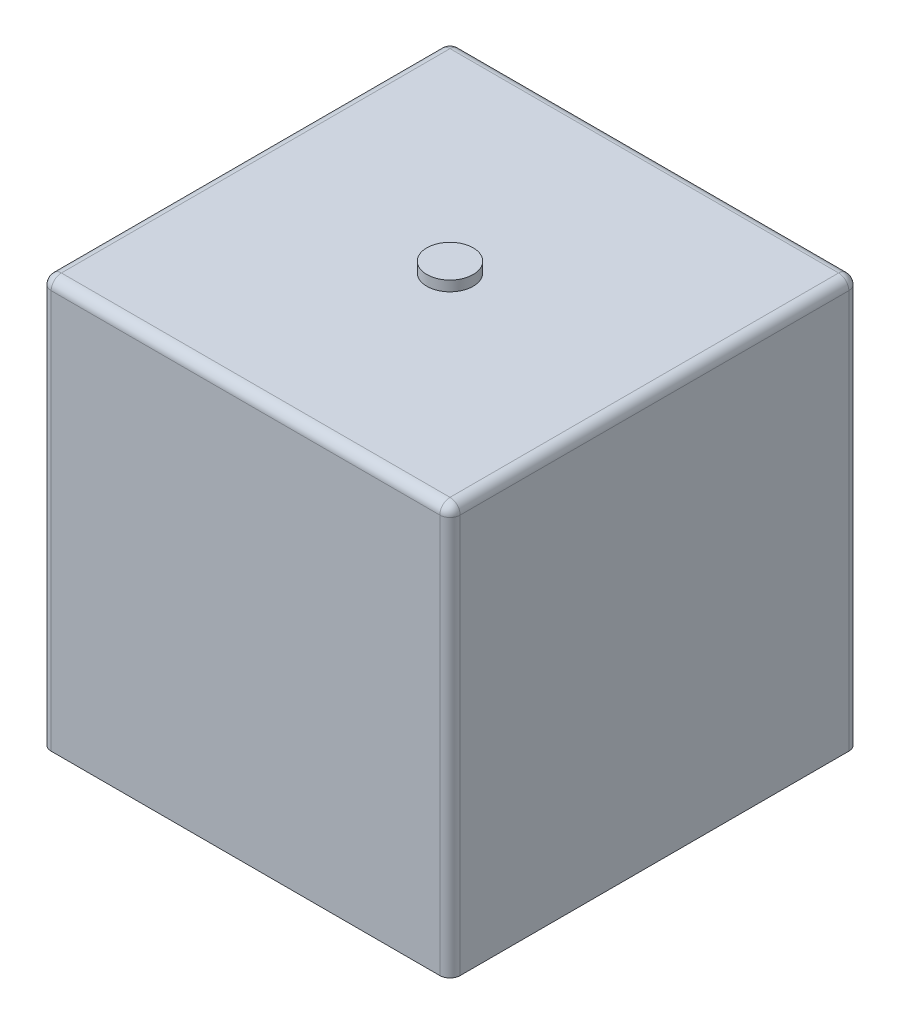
ISO-10303-21;
HEADER;
FILE_DESCRIPTION(('STEP AP214'),'2;1');
FILE_NAME('part.step','',(''),(''),'','','');
FILE_SCHEMA(('AUTOMOTIVE_DESIGN { 1 0 10303 214 1 1 1 1 }'));
ENDSEC;
DATA;
#1=APPLICATION_CONTEXT('core data for automotive mechanical design processes');
#2=APPLICATION_PROTOCOL_DEFINITION('international standard','automotive_design',2000,#1);
#3=PRODUCT_CONTEXT('',#1,'mechanical');
#4=PRODUCT('Part','Part','',(#3));
#5=PRODUCT_RELATED_PRODUCT_CATEGORY('part','',(#4));
#6=PRODUCT_DEFINITION_FORMATION('','',#4);
#7=PRODUCT_DEFINITION_CONTEXT('part definition',#1,'design');
#8=PRODUCT_DEFINITION('design','',#6,#7);
#9=PRODUCT_DEFINITION_SHAPE('','',#8);
#10=(LENGTH_UNIT() NAMED_UNIT(*) SI_UNIT(.MILLI.,.METRE.));
#11=(NAMED_UNIT(*) PLANE_ANGLE_UNIT() SI_UNIT($,.RADIAN.));
#12=(NAMED_UNIT(*) SI_UNIT($,.STERADIAN.) SOLID_ANGLE_UNIT());
#13=UNCERTAINTY_MEASURE_WITH_UNIT(LENGTH_MEASURE(1.E-05),#10,'distance_accuracy_value','');
#14=(GEOMETRIC_REPRESENTATION_CONTEXT(3) GLOBAL_UNCERTAINTY_ASSIGNED_CONTEXT((#13)) GLOBAL_UNIT_ASSIGNED_CONTEXT((#10,
#11,#12)) REPRESENTATION_CONTEXT('',''));
#15=CARTESIAN_POINT('',(0.,0.,0.));
#16=DIRECTION('',(0.,0.,1.));
#17=DIRECTION('',(1.,0.,0.));
#18=AXIS2_PLACEMENT_3D('',#15,#16,#17);
#19=CARTESIAN_POINT('',(0.,0.,20.));
#20=DIRECTION('',(1.,0.,0.));
#21=DIRECTION('',(0.,0.,-1.));
#22=AXIS2_PLACEMENT_3D('',#19,#20,#21);
#23=PLANE('',#22);
#24=DIRECTION('',(0.,0.,-1.));
#25=VECTOR('',#24,1.);
#26=CARTESIAN_POINT('',(0.,19.5,20.));
#27=LINE('',#26,#25);
#28=CARTESIAN_POINT('',(0.,19.5,19.5));
#29=VERTEX_POINT('',#28);
#30=CARTESIAN_POINT('',(0.,19.5,0.5));
#31=VERTEX_POINT('',#30);
#32=EDGE_CURVE('E145',#29,#31,#27,.T.);
#33=ORIENTED_EDGE('',*,*,#32,.T.);
#34=DIRECTION('',(0.,-1.,0.));
#35=VECTOR('',#34,1.);
#36=CARTESIAN_POINT('',(0.,0.,0.5));
#37=LINE('',#36,#35);
#38=CARTESIAN_POINT('',(0.,0.,0.5));
#39=VERTEX_POINT('',#38);
#40=EDGE_CURVE('E131',#31,#39,#37,.T.);
#41=ORIENTED_EDGE('',*,*,#40,.T.);
#42=DIRECTION('',(0.,0.,-1.));
#43=VECTOR('',#42,1.);
#44=CARTESIAN_POINT('',(0.,0.,20.));
#45=LINE('',#44,#43);
#46=CARTESIAN_POINT('',(0.,0.,19.5));
#47=VERTEX_POINT('',#46);
#48=EDGE_CURVE('E124',#47,#39,#45,.T.);
#49=ORIENTED_EDGE('',*,*,#48,.F.);
#50=DIRECTION('',(0.,-1.,0.));
#51=VECTOR('',#50,1.);
#52=CARTESIAN_POINT('',(0.,0.,19.5));
#53=LINE('',#52,#51);
#54=EDGE_CURVE('E135',#47,#29,#53,.F.);
#55=ORIENTED_EDGE('',*,*,#54,.T.);
#56=EDGE_LOOP('',(#33,#41,#49,#55));
#57=FACE_BOUND('',#56,.T.);
#58=ADVANCED_FACE('F41',(#57),#23,.F.);
#59=CARTESIAN_POINT('',(0.,0.,20.));
#60=DIRECTION('',(0.,1.,0.));
#61=DIRECTION('',(0.,0.,1.));
#62=AXIS2_PLACEMENT_3D('',#59,#60,#61);
#63=PLANE('',#62);
#64=ORIENTED_EDGE('',*,*,#48,.T.);
#65=CARTESIAN_POINT('',(0.5,0.,0.5));
#66=DIRECTION('',(0.,1.,0.));
#67=DIRECTION('',(0.,0.,1.));
#68=AXIS2_PLACEMENT_3D('',#65,#66,#67);
#69=CIRCLE('',#68,0.5);
#70=CARTESIAN_POINT('',(0.5,0.,0.));
#71=VERTEX_POINT('',#70);
#72=EDGE_CURVE('E155',#39,#71,#69,.F.);
#73=ORIENTED_EDGE('',*,*,#72,.T.);
#74=DIRECTION('',(1.,0.,0.));
#75=VECTOR('',#74,1.);
#76=CARTESIAN_POINT('',(0.,0.,0.));
#77=LINE('',#76,#75);
#78=CARTESIAN_POINT('',(19.5,0.,0.));
#79=VERTEX_POINT('',#78);
#80=EDGE_CURVE('E216',#71,#79,#77,.T.);
#81=ORIENTED_EDGE('',*,*,#80,.T.);
#82=CARTESIAN_POINT('',(19.5,0.,0.5));
#83=DIRECTION('',(0.,1.,0.));
#84=DIRECTION('',(0.,0.,1.));
#85=AXIS2_PLACEMENT_3D('',#82,#83,#84);
#86=CIRCLE('',#85,0.5);
#87=CARTESIAN_POINT('',(20.,0.,0.5));
#88=VERTEX_POINT('',#87);
#89=EDGE_CURVE('E153',#79,#88,#86,.F.);
#90=ORIENTED_EDGE('',*,*,#89,.T.);
#91=DIRECTION('',(0.,0.,-1.));
#92=VECTOR('',#91,1.);
#93=CARTESIAN_POINT('',(20.,0.,20.));
#94=LINE('',#93,#92);
#95=CARTESIAN_POINT('',(20.,0.,19.5));
#96=VERTEX_POINT('',#95);
#97=EDGE_CURVE('E139',#96,#88,#94,.T.);
#98=ORIENTED_EDGE('',*,*,#97,.F.);
#99=CARTESIAN_POINT('',(19.5,0.,19.5));
#100=DIRECTION('',(0.,1.,0.));
#101=DIRECTION('',(0.,0.,1.));
#102=AXIS2_PLACEMENT_3D('',#99,#100,#101);
#103=CIRCLE('',#102,0.5);
#104=CARTESIAN_POINT('',(19.5,0.,20.));
#105=VERTEX_POINT('',#104);
#106=EDGE_CURVE('E130',#96,#105,#103,.F.);
#107=ORIENTED_EDGE('',*,*,#106,.T.);
#108=DIRECTION('',(1.,0.,0.));
#109=VECTOR('',#108,1.);
#110=CARTESIAN_POINT('',(0.,0.,20.));
#111=LINE('',#110,#109);
#112=CARTESIAN_POINT('',(0.5,0.,20.));
#113=VERTEX_POINT('',#112);
#114=EDGE_CURVE('E126',#113,#105,#111,.T.);
#115=ORIENTED_EDGE('',*,*,#114,.F.);
#116=CARTESIAN_POINT('',(0.5,0.,19.5));
#117=DIRECTION('',(0.,1.,0.));
#118=DIRECTION('',(0.,0.,1.));
#119=AXIS2_PLACEMENT_3D('',#116,#117,#118);
#120=CIRCLE('',#119,0.5);
#121=EDGE_CURVE('E121',#113,#47,#120,.F.);
#122=ORIENTED_EDGE('',*,*,#121,.T.);
#123=EDGE_LOOP('',(#64,#73,#81,#90,#98,#107,#115,#122));
#124=FACE_BOUND('',#123,.T.);
#125=ADVANCED_FACE('F123',(#124),#63,.F.);
#126=CARTESIAN_POINT('',(20.,0.,20.));
#127=DIRECTION('',(-1.,0.,0.));
#128=DIRECTION('',(0.,0.,1.));
#129=AXIS2_PLACEMENT_3D('',#126,#127,#128);
#130=PLANE('',#129);
#131=ORIENTED_EDGE('',*,*,#97,.T.);
#132=DIRECTION('',(0.,1.,0.));
#133=VECTOR('',#132,1.);
#134=CARTESIAN_POINT('',(20.,20.,0.5));
#135=LINE('',#134,#133);
#136=CARTESIAN_POINT('',(20.,19.5,0.5));
#137=VERTEX_POINT('',#136);
#138=EDGE_CURVE('E167',#88,#137,#135,.T.);
#139=ORIENTED_EDGE('',*,*,#138,.T.);
#140=DIRECTION('',(0.,0.,-1.));
#141=VECTOR('',#140,1.);
#142=CARTESIAN_POINT('',(20.,19.5,20.));
#143=LINE('',#142,#141);
#144=CARTESIAN_POINT('',(20.,19.5,19.5));
#145=VERTEX_POINT('',#144);
#146=EDGE_CURVE('E163',#137,#145,#143,.F.);
#147=ORIENTED_EDGE('',*,*,#146,.T.);
#148=DIRECTION('',(0.,1.,0.));
#149=VECTOR('',#148,1.);
#150=CARTESIAN_POINT('',(20.,0.,19.5));
#151=LINE('',#150,#149);
#152=EDGE_CURVE('E165',#145,#96,#151,.F.);
#153=ORIENTED_EDGE('',*,*,#152,.T.);
#154=EDGE_LOOP('',(#131,#139,#147,#153));
#155=FACE_BOUND('',#154,.T.);
#156=ADVANCED_FACE('F228',(#155),#130,.F.);
#157=CARTESIAN_POINT('',(0.,20.,20.));
#158=DIRECTION('',(0.,-1.,0.));
#159=DIRECTION('',(0.,0.,-1.));
#160=AXIS2_PLACEMENT_3D('',#157,#158,#159);
#161=PLANE('',#160);
#162=DIRECTION('',(-1.,0.,0.));
#163=VECTOR('',#162,1.);
#164=CARTESIAN_POINT('',(0.,20.,19.5));
#165=LINE('',#164,#163);
#166=CARTESIAN_POINT('',(0.5,20.,19.5));
#167=VERTEX_POINT('',#166);
#168=CARTESIAN_POINT('',(19.5,20.,19.5));
#169=VERTEX_POINT('',#168);
#170=EDGE_CURVE('E64',#167,#169,#165,.F.);
#171=ORIENTED_EDGE('',*,*,#170,.T.);
#172=DIRECTION('',(0.,0.,-1.));
#173=VECTOR('',#172,1.);
#174=CARTESIAN_POINT('',(19.5,20.,20.));
#175=LINE('',#174,#173);
#176=CARTESIAN_POINT('',(19.5,20.,0.5));
#177=VERTEX_POINT('',#176);
#178=EDGE_CURVE('E11',#169,#177,#175,.T.);
#179=ORIENTED_EDGE('',*,*,#178,.T.);
#180=DIRECTION('',(-1.,0.,0.));
#181=VECTOR('',#180,1.);
#182=CARTESIAN_POINT('',(0.,20.,0.5));
#183=LINE('',#182,#181);
#184=CARTESIAN_POINT('',(0.5,20.,0.5));
#185=VERTEX_POINT('',#184);
#186=EDGE_CURVE('E50',#177,#185,#183,.T.);
#187=ORIENTED_EDGE('',*,*,#186,.T.);
#188=DIRECTION('',(0.,0.,-1.));
#189=VECTOR('',#188,1.);
#190=CARTESIAN_POINT('',(0.5,20.,20.));
#191=LINE('',#190,#189);
#192=EDGE_CURVE('E175',#185,#167,#191,.F.);
#193=ORIENTED_EDGE('',*,*,#192,.T.);
#194=EDGE_LOOP('',(#171,#179,#187,#193));
#195=FACE_BOUND('',#194,.T.);
#196=CARTESIAN_POINT('',(10.,20.,10.));
#197=DIRECTION('',(0.,-1.,0.));
#198=DIRECTION('',(0.,0.,-1.));
#199=AXIS2_PLACEMENT_3D('',#196,#197,#198);
#200=CIRCLE('',#199,1.13146081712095);
#201=CARTESIAN_POINT('',(10.,20.,8.86853918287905));
#202=VERTEX_POINT('',#201);
#203=EDGE_CURVE('E138',#202,#202,#200,.F.);
#204=ORIENTED_EDGE('',*,*,#203,.F.);
#205=EDGE_LOOP('',(#204));
#206=FACE_BOUND('',#205,.T.);
#207=ADVANCED_FACE('F240',(#195,#206),#161,.F.);
#208=CARTESIAN_POINT('',(0.,0.,20.));
#209=DIRECTION('',(0.,0.,-1.));
#210=DIRECTION('',(-1.,0.,0.));
#211=AXIS2_PLACEMENT_3D('',#208,#209,#210);
#212=PLANE('',#211);
#213=ORIENTED_EDGE('',*,*,#114,.T.);
#214=DIRECTION('',(0.,1.,0.));
#215=VECTOR('',#214,1.);
#216=CARTESIAN_POINT('',(19.5,0.,20.));
#217=LINE('',#216,#215);
#218=CARTESIAN_POINT('',(19.5,19.5,20.));
#219=VERTEX_POINT('',#218);
#220=EDGE_CURVE('E173',#105,#219,#217,.T.);
#221=ORIENTED_EDGE('',*,*,#220,.T.);
#222=DIRECTION('',(-1.,0.,0.));
#223=VECTOR('',#222,1.);
#224=CARTESIAN_POINT('',(0.,19.5,20.));
#225=LINE('',#224,#223);
#226=CARTESIAN_POINT('',(0.5,19.5,20.));
#227=VERTEX_POINT('',#226);
#228=EDGE_CURVE('E171',#219,#227,#225,.T.);
#229=ORIENTED_EDGE('',*,*,#228,.T.);
#230=DIRECTION('',(0.,-1.,0.));
#231=VECTOR('',#230,1.);
#232=CARTESIAN_POINT('',(0.5,0.,20.));
#233=LINE('',#232,#231);
#234=EDGE_CURVE('E169',#227,#113,#233,.T.);
#235=ORIENTED_EDGE('',*,*,#234,.T.);
#236=EDGE_LOOP('',(#213,#221,#229,#235));
#237=FACE_BOUND('',#236,.T.);
#238=ADVANCED_FACE('F260',(#237),#212,.F.);
#239=CARTESIAN_POINT('',(0.,0.,0.));
#240=DIRECTION('',(0.,0.,-1.));
#241=DIRECTION('',(-1.,0.,0.));
#242=AXIS2_PLACEMENT_3D('',#239,#240,#241);
#243=PLANE('',#242);
#244=ORIENTED_EDGE('',*,*,#80,.F.);
#245=DIRECTION('',(0.,-1.,0.));
#246=VECTOR('',#245,1.);
#247=CARTESIAN_POINT('',(0.5,20.,0.));
#248=LINE('',#247,#246);
#249=CARTESIAN_POINT('',(0.5,19.5,0.));
#250=VERTEX_POINT('',#249);
#251=EDGE_CURVE('E161',#71,#250,#248,.F.);
#252=ORIENTED_EDGE('',*,*,#251,.T.);
#253=DIRECTION('',(-1.,0.,0.));
#254=VECTOR('',#253,1.);
#255=CARTESIAN_POINT('',(20.,19.5,0.));
#256=LINE('',#255,#254);
#257=CARTESIAN_POINT('',(19.5,19.5,0.));
#258=VERTEX_POINT('',#257);
#259=EDGE_CURVE('E157',#250,#258,#256,.F.);
#260=ORIENTED_EDGE('',*,*,#259,.T.);
#261=DIRECTION('',(0.,1.,0.));
#262=VECTOR('',#261,1.);
#263=CARTESIAN_POINT('',(19.5,0.,0.));
#264=LINE('',#263,#262);
#265=EDGE_CURVE('E159',#258,#79,#264,.F.);
#266=ORIENTED_EDGE('',*,*,#265,.T.);
#267=EDGE_LOOP('',(#244,#252,#260,#266));
#268=FACE_BOUND('',#267,.T.);
#269=ADVANCED_FACE('F257',(#268),#243,.T.);
#270=CARTESIAN_POINT('',(10.,20.5,10.));
#271=DIRECTION('',(0.,-1.,0.));
#272=DIRECTION('',(0.,0.,-1.));
#273=AXIS2_PLACEMENT_3D('',#270,#271,#272);
#274=CYLINDRICAL_SURFACE('',#273,1.13146081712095);
#275=CARTESIAN_POINT('',(10.,20.5,10.));
#276=DIRECTION('',(0.,1.,0.));
#277=DIRECTION('',(0.,0.,1.));
#278=AXIS2_PLACEMENT_3D('',#275,#276,#277);
#279=CIRCLE('',#278,1.13146081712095);
#280=CARTESIAN_POINT('',(10.,20.5,11.1314608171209));
#281=VERTEX_POINT('',#280);
#282=EDGE_CURVE('E211',#281,#281,#279,.T.);
#283=ORIENTED_EDGE('',*,*,#282,.F.);
#284=EDGE_LOOP('',(#283));
#285=FACE_BOUND('',#284,.T.);
#286=ORIENTED_EDGE('',*,*,#203,.T.);
#287=EDGE_LOOP('',(#286));
#288=FACE_BOUND('',#287,.T.);
#289=ADVANCED_FACE('F259',(#285,#288),#274,.T.);
#290=CARTESIAN_POINT('',(10.,20.5,10.));
#291=DIRECTION('',(0.,1.,0.));
#292=DIRECTION('',(0.,0.,1.));
#293=AXIS2_PLACEMENT_3D('',#290,#291,#292);
#294=PLANE('',#293);
#295=ORIENTED_EDGE('',*,*,#282,.T.);
#296=EDGE_LOOP('',(#295));
#297=FACE_BOUND('',#296,.T.);
#298=ADVANCED_FACE('F267',(#297),#294,.T.);
#299=CARTESIAN_POINT('',(19.5,0.,19.5));
#300=DIRECTION('',(0.,1.,0.));
#301=DIRECTION('',(0.,0.,1.));
#302=AXIS2_PLACEMENT_3D('',#299,#300,#301);
#303=CYLINDRICAL_SURFACE('',#302,0.5);
#304=CARTESIAN_POINT('',(19.5,19.5,19.5));
#305=DIRECTION('',(0.,1.,0.));
#306=DIRECTION('',(0.,0.,1.));
#307=AXIS2_PLACEMENT_3D('',#304,#305,#306);
#308=CIRCLE('',#307,0.5);
#309=EDGE_CURVE('E45',#219,#145,#308,.T.);
#310=ORIENTED_EDGE('',*,*,#309,.F.);
#311=ORIENTED_EDGE('',*,*,#220,.F.);
#312=ORIENTED_EDGE('',*,*,#106,.F.);
#313=ORIENTED_EDGE('',*,*,#152,.F.);
#314=EDGE_LOOP('',(#310,#311,#312,#313));
#315=FACE_BOUND('',#314,.T.);
#316=ADVANCED_FACE('F43',(#315),#303,.T.);
#317=CARTESIAN_POINT('',(19.5,19.5,19.5));
#318=DIRECTION('',(1.,0.,0.));
#319=DIRECTION('',(0.,0.,-1.));
#320=AXIS2_PLACEMENT_3D('',#317,#318,#319);
#321=SPHERICAL_SURFACE('',#320,0.5);
#322=CARTESIAN_POINT('',(19.5,19.5,19.5));
#323=DIRECTION('',(1.,0.,0.));
#324=DIRECTION('',(0.,0.,-1.));
#325=AXIS2_PLACEMENT_3D('',#322,#323,#324);
#326=CIRCLE('',#325,0.5);
#327=EDGE_CURVE('E203',#219,#169,#326,.F.);
#328=ORIENTED_EDGE('',*,*,#327,.F.);
#329=ORIENTED_EDGE('',*,*,#309,.T.);
#330=CARTESIAN_POINT('',(19.5,19.5,19.5));
#331=DIRECTION('',(0.,0.,1.));
#332=DIRECTION('',(1.,0.,0.));
#333=AXIS2_PLACEMENT_3D('',#330,#331,#332);
#334=CIRCLE('',#333,0.5);
#335=EDGE_CURVE('E204',#169,#145,#334,.F.);
#336=ORIENTED_EDGE('',*,*,#335,.F.);
#337=EDGE_LOOP('',(#328,#329,#336));
#338=FACE_BOUND('',#337,.T.);
#339=ADVANCED_FACE('F305',(#338),#321,.T.);
#340=CARTESIAN_POINT('',(19.5,0.,0.5));
#341=DIRECTION('',(0.,-1.,0.));
#342=DIRECTION('',(0.,0.,-1.));
#343=AXIS2_PLACEMENT_3D('',#340,#341,#342);
#344=CYLINDRICAL_SURFACE('',#343,0.5);
#345=ORIENTED_EDGE('',*,*,#89,.F.);
#346=ORIENTED_EDGE('',*,*,#265,.F.);
#347=CARTESIAN_POINT('',(19.5,19.5,0.5));
#348=DIRECTION('',(0.,1.,0.));
#349=DIRECTION('',(0.,0.,1.));
#350=AXIS2_PLACEMENT_3D('',#347,#348,#349);
#351=CIRCLE('',#350,0.5);
#352=EDGE_CURVE('E200',#137,#258,#351,.T.);
#353=ORIENTED_EDGE('',*,*,#352,.F.);
#354=ORIENTED_EDGE('',*,*,#138,.F.);
#355=EDGE_LOOP('',(#345,#346,#353,#354));
#356=FACE_BOUND('',#355,.T.);
#357=ADVANCED_FACE('F234',(#356),#344,.T.);
#358=CARTESIAN_POINT('',(19.5,19.5,20.));
#359=DIRECTION('',(0.,0.,-1.));
#360=DIRECTION('',(-1.,0.,0.));
#361=AXIS2_PLACEMENT_3D('',#358,#359,#360);
#362=CYLINDRICAL_SURFACE('',#361,0.5);
#363=ORIENTED_EDGE('',*,*,#335,.T.);
#364=ORIENTED_EDGE('',*,*,#146,.F.);
#365=CARTESIAN_POINT('',(19.5,19.5,0.5));
#366=DIRECTION('',(0.,0.,-1.));
#367=DIRECTION('',(-1.,0.,0.));
#368=AXIS2_PLACEMENT_3D('',#365,#366,#367);
#369=CIRCLE('',#368,0.5);
#370=EDGE_CURVE('E197',#177,#137,#369,.T.);
#371=ORIENTED_EDGE('',*,*,#370,.F.);
#372=ORIENTED_EDGE('',*,*,#178,.F.);
#373=EDGE_LOOP('',(#363,#364,#371,#372));
#374=FACE_BOUND('',#373,.T.);
#375=ADVANCED_FACE('F239',(#374),#362,.T.);
#376=CARTESIAN_POINT('',(0.,19.5,19.5));
#377=DIRECTION('',(-1.,0.,0.));
#378=DIRECTION('',(0.,0.,1.));
#379=AXIS2_PLACEMENT_3D('',#376,#377,#378);
#380=CYLINDRICAL_SURFACE('',#379,0.5);
#381=ORIENTED_EDGE('',*,*,#327,.T.);
#382=ORIENTED_EDGE('',*,*,#170,.F.);
#383=CARTESIAN_POINT('',(0.5,19.5,19.5));
#384=DIRECTION('',(-1.,0.,0.));
#385=DIRECTION('',(0.,0.,1.));
#386=AXIS2_PLACEMENT_3D('',#383,#384,#385);
#387=CIRCLE('',#386,0.5);
#388=EDGE_CURVE('E194',#227,#167,#387,.T.);
#389=ORIENTED_EDGE('',*,*,#388,.F.);
#390=ORIENTED_EDGE('',*,*,#228,.F.);
#391=EDGE_LOOP('',(#381,#382,#389,#390));
#392=FACE_BOUND('',#391,.T.);
#393=ADVANCED_FACE('F298',(#392),#380,.T.);
#394=CARTESIAN_POINT('',(0.5,0.,19.5));
#395=DIRECTION('',(0.,-1.,0.));
#396=DIRECTION('',(0.,0.,-1.));
#397=AXIS2_PLACEMENT_3D('',#394,#395,#396);
#398=CYLINDRICAL_SURFACE('',#397,0.5);
#399=ORIENTED_EDGE('',*,*,#121,.F.);
#400=ORIENTED_EDGE('',*,*,#234,.F.);
#401=CARTESIAN_POINT('',(0.5,19.5,19.5));
#402=DIRECTION('',(0.,1.,0.));
#403=DIRECTION('',(0.,0.,1.));
#404=AXIS2_PLACEMENT_3D('',#401,#402,#403);
#405=CIRCLE('',#404,0.5);
#406=EDGE_CURVE('E143',#29,#227,#405,.T.);
#407=ORIENTED_EDGE('',*,*,#406,.F.);
#408=ORIENTED_EDGE('',*,*,#54,.F.);
#409=EDGE_LOOP('',(#399,#400,#407,#408));
#410=FACE_BOUND('',#409,.T.);
#411=ADVANCED_FACE('F141',(#410),#398,.T.);
#412=CARTESIAN_POINT('',(19.5,19.5,0.5));
#413=DIRECTION('',(1.,0.,0.));
#414=DIRECTION('',(0.,0.,-1.));
#415=AXIS2_PLACEMENT_3D('',#412,#413,#414);
#416=SPHERICAL_SURFACE('',#415,0.5);
#417=ORIENTED_EDGE('',*,*,#370,.T.);
#418=ORIENTED_EDGE('',*,*,#352,.T.);
#419=CARTESIAN_POINT('',(19.5,19.5,0.5));
#420=DIRECTION('',(1.,0.,0.));
#421=DIRECTION('',(0.,0.,-1.));
#422=AXIS2_PLACEMENT_3D('',#419,#420,#421);
#423=CIRCLE('',#422,0.5);
#424=EDGE_CURVE('E191',#177,#258,#423,.F.);
#425=ORIENTED_EDGE('',*,*,#424,.F.);
#426=EDGE_LOOP('',(#417,#418,#425));
#427=FACE_BOUND('',#426,.T.);
#428=ADVANCED_FACE('F238',(#427),#416,.T.);
#429=CARTESIAN_POINT('',(0.5,19.5,19.5));
#430=DIRECTION('',(0.,0.,1.));
#431=DIRECTION('',(1.,0.,0.));
#432=AXIS2_PLACEMENT_3D('',#429,#430,#431);
#433=SPHERICAL_SURFACE('',#432,0.5);
#434=ORIENTED_EDGE('',*,*,#406,.T.);
#435=ORIENTED_EDGE('',*,*,#388,.T.);
#436=CARTESIAN_POINT('',(0.5,19.5,19.5));
#437=DIRECTION('',(0.,0.,1.));
#438=DIRECTION('',(1.,0.,0.));
#439=AXIS2_PLACEMENT_3D('',#436,#437,#438);
#440=CIRCLE('',#439,0.5);
#441=EDGE_CURVE('E188',#29,#167,#440,.F.);
#442=ORIENTED_EDGE('',*,*,#441,.F.);
#443=EDGE_LOOP('',(#434,#435,#442));
#444=FACE_BOUND('',#443,.T.);
#445=ADVANCED_FACE('F290',(#444),#433,.T.);
#446=CARTESIAN_POINT('',(0.,19.5,0.5));
#447=DIRECTION('',(1.,0.,0.));
#448=DIRECTION('',(0.,0.,-1.));
#449=AXIS2_PLACEMENT_3D('',#446,#447,#448);
#450=CYLINDRICAL_SURFACE('',#449,0.5);
#451=ORIENTED_EDGE('',*,*,#424,.T.);
#452=ORIENTED_EDGE('',*,*,#259,.F.);
#453=CARTESIAN_POINT('',(0.5,19.5,0.5));
#454=DIRECTION('',(-1.,0.,0.));
#455=DIRECTION('',(0.,0.,1.));
#456=AXIS2_PLACEMENT_3D('',#453,#454,#455);
#457=CIRCLE('',#456,0.5);
#458=EDGE_CURVE('E185',#185,#250,#457,.T.);
#459=ORIENTED_EDGE('',*,*,#458,.F.);
#460=ORIENTED_EDGE('',*,*,#186,.F.);
#461=EDGE_LOOP('',(#451,#452,#459,#460));
#462=FACE_BOUND('',#461,.T.);
#463=ADVANCED_FACE('F249',(#462),#450,.T.);
#464=CARTESIAN_POINT('',(0.5,19.5,20.));
#465=DIRECTION('',(0.,0.,-1.));
#466=DIRECTION('',(-1.,0.,0.));
#467=AXIS2_PLACEMENT_3D('',#464,#465,#466);
#468=CYLINDRICAL_SURFACE('',#467,0.5);
#469=ORIENTED_EDGE('',*,*,#441,.T.);
#470=ORIENTED_EDGE('',*,*,#192,.F.);
#471=CARTESIAN_POINT('',(0.5,19.5,0.5));
#472=DIRECTION('',(0.,0.,-1.));
#473=DIRECTION('',(-1.,0.,0.));
#474=AXIS2_PLACEMENT_3D('',#471,#472,#473);
#475=CIRCLE('',#474,0.5);
#476=EDGE_CURVE('E182',#31,#185,#475,.T.);
#477=ORIENTED_EDGE('',*,*,#476,.F.);
#478=ORIENTED_EDGE('',*,*,#32,.F.);
#479=EDGE_LOOP('',(#469,#470,#477,#478));
#480=FACE_BOUND('',#479,.T.);
#481=ADVANCED_FACE('F245',(#480),#468,.T.);
#482=CARTESIAN_POINT('',(0.5,19.5,0.5));
#483=DIRECTION('',(0.,1.,0.));
#484=DIRECTION('',(0.,0.,1.));
#485=AXIS2_PLACEMENT_3D('',#482,#483,#484);
#486=SPHERICAL_SURFACE('',#485,0.5);
#487=ORIENTED_EDGE('',*,*,#476,.T.);
#488=ORIENTED_EDGE('',*,*,#458,.T.);
#489=CARTESIAN_POINT('',(0.5,19.5,0.5));
#490=DIRECTION('',(0.,1.,0.));
#491=DIRECTION('',(0.,0.,1.));
#492=AXIS2_PLACEMENT_3D('',#489,#490,#491);
#493=CIRCLE('',#492,0.5);
#494=EDGE_CURVE('E179',#31,#250,#493,.F.);
#495=ORIENTED_EDGE('',*,*,#494,.F.);
#496=EDGE_LOOP('',(#487,#488,#495));
#497=FACE_BOUND('',#496,.T.);
#498=ADVANCED_FACE('F251',(#497),#486,.T.);
#499=CARTESIAN_POINT('',(0.5,0.,0.5));
#500=DIRECTION('',(0.,1.,0.));
#501=DIRECTION('',(0.,0.,1.));
#502=AXIS2_PLACEMENT_3D('',#499,#500,#501);
#503=CYLINDRICAL_SURFACE('',#502,0.5);
#504=ORIENTED_EDGE('',*,*,#494,.T.);
#505=ORIENTED_EDGE('',*,*,#251,.F.);
#506=ORIENTED_EDGE('',*,*,#72,.F.);
#507=ORIENTED_EDGE('',*,*,#40,.F.);
#508=EDGE_LOOP('',(#504,#505,#506,#507));
#509=FACE_BOUND('',#508,.T.);
#510=ADVANCED_FACE('F254',(#509),#503,.T.);
#511=CLOSED_SHELL('',(#58,#125,#156,#207,#238,#269,#289,#298,#316,#339,#357,#375,#393,#411,#428,
#445,#463,#481,#498,#510));
#512=MANIFOLD_SOLID_BREP('B2',#511);
#513=ADVANCED_BREP_SHAPE_REPRESENTATION('',(#18,#512),#14);
#514=SHAPE_DEFINITION_REPRESENTATION(#9,#513);
ENDSEC;
END-ISO-10303-21;
